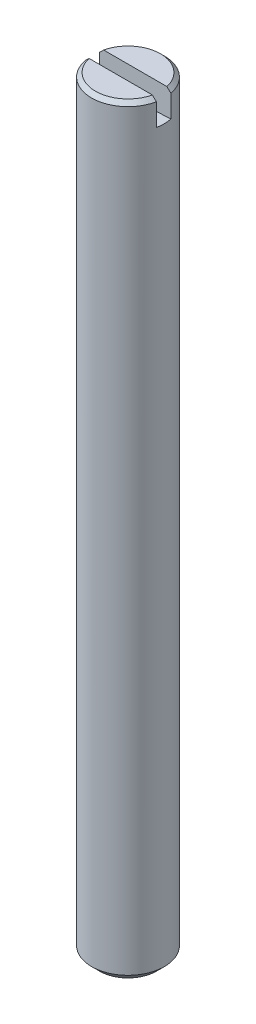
ISO-10303-21;
HEADER;
FILE_DESCRIPTION(('STEP AP214'),'2;1');
FILE_NAME('part.step','',(''),(''),'','','');
FILE_SCHEMA(('AUTOMOTIVE_DESIGN { 1 0 10303 214 1 1 1 1 }'));
ENDSEC;
DATA;
#1=APPLICATION_CONTEXT('core data for automotive mechanical design processes');
#2=APPLICATION_PROTOCOL_DEFINITION('international standard','automotive_design',2000,#1);
#3=PRODUCT_CONTEXT('',#1,'mechanical');
#4=PRODUCT('Part','Part','',(#3));
#5=PRODUCT_RELATED_PRODUCT_CATEGORY('part','',(#4));
#6=PRODUCT_DEFINITION_FORMATION('','',#4);
#7=PRODUCT_DEFINITION_CONTEXT('part definition',#1,'design');
#8=PRODUCT_DEFINITION('design','',#6,#7);
#9=PRODUCT_DEFINITION_SHAPE('','',#8);
#10=(LENGTH_UNIT() NAMED_UNIT(*) SI_UNIT(.MILLI.,.METRE.));
#11=(NAMED_UNIT(*) PLANE_ANGLE_UNIT() SI_UNIT($,.RADIAN.));
#12=(NAMED_UNIT(*) SI_UNIT($,.STERADIAN.) SOLID_ANGLE_UNIT());
#13=UNCERTAINTY_MEASURE_WITH_UNIT(LENGTH_MEASURE(1.E-05),#10,'distance_accuracy_value','');
#14=(GEOMETRIC_REPRESENTATION_CONTEXT(3) GLOBAL_UNCERTAINTY_ASSIGNED_CONTEXT((#13)) GLOBAL_UNIT_ASSIGNED_CONTEXT((#10,
#11,#12)) REPRESENTATION_CONTEXT('',''));
#15=CARTESIAN_POINT('',(0.,0.,0.));
#16=DIRECTION('',(0.,0.,1.));
#17=DIRECTION('',(1.,0.,0.));
#18=AXIS2_PLACEMENT_3D('',#15,#16,#17);
#19=CARTESIAN_POINT('',(0.,22.,0.));
#20=DIRECTION('',(0.,-1.,0.));
#21=DIRECTION('',(0.,0.,-1.));
#22=AXIS2_PLACEMENT_3D('',#19,#20,#21);
#23=PLANE('',#22);
#24=CARTESIAN_POINT('',(0.,21.9999999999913,0.));
#25=DIRECTION('',(0.,-1.,0.));
#26=DIRECTION('',(0.,0.,-1.));
#27=AXIS2_PLACEMENT_3D('',#24,#25,#26);
#28=CIRCLE('',#27,1.78549999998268);
#29=CARTESIAN_POINT('',(-1.74011788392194,21.9999999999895,-0.4));
#30=VERTEX_POINT('',#29);
#31=CARTESIAN_POINT('',(1.74011788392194,21.9999999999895,-0.4));
#32=VERTEX_POINT('',#31);
#33=EDGE_CURVE('E87',#30,#32,#28,.T.);
#34=ORIENTED_EDGE('',*,*,#33,.F.);
#35=DIRECTION('',(1.,0.,0.));
#36=VECTOR('',#35,1.);
#37=CARTESIAN_POINT('',(0.,22.,-0.4));
#38=LINE('',#37,#36);
#39=EDGE_CURVE('E19',#32,#30,#38,.F.);
#40=ORIENTED_EDGE('',*,*,#39,.F.);
#41=EDGE_LOOP('',(#34,#40));
#42=FACE_BOUND('',#41,.T.);
#43=ADVANCED_FACE('F14',(#42),#23,.F.);
#44=CARTESIAN_POINT('',(0.,22.,0.));
#45=DIRECTION('',(0.,-1.,0.));
#46=DIRECTION('',(0.,0.,-1.));
#47=AXIS2_PLACEMENT_3D('',#44,#45,#46);
#48=PLANE('',#47);
#49=DIRECTION('',(1.,0.,0.));
#50=VECTOR('',#49,1.);
#51=CARTESIAN_POINT('',(0.,22.,0.4));
#52=LINE('',#51,#50);
#53=CARTESIAN_POINT('',(-1.74011788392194,21.9999999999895,0.4));
#54=VERTEX_POINT('',#53);
#55=CARTESIAN_POINT('',(1.74011788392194,21.9999999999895,0.4));
#56=VERTEX_POINT('',#55);
#57=EDGE_CURVE('E81',#54,#56,#52,.T.);
#58=ORIENTED_EDGE('',*,*,#57,.F.);
#59=CARTESIAN_POINT('',(0.,21.9999999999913,0.));
#60=DIRECTION('',(0.,-1.,0.));
#61=DIRECTION('',(0.,0.,-1.));
#62=AXIS2_PLACEMENT_3D('',#59,#60,#61);
#63=CIRCLE('',#62,1.78549999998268);
#64=EDGE_CURVE('E74',#56,#54,#63,.T.);
#65=ORIENTED_EDGE('',*,*,#64,.F.);
#66=EDGE_LOOP('',(#58,#65));
#67=FACE_BOUND('',#66,.T.);
#68=ADVANCED_FACE('F86',(#67),#48,.F.);
#69=CARTESIAN_POINT('',(0.,21.7854999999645,0.));
#70=DIRECTION('',(0.,-1.,0.));
#71=DIRECTION('',(0.,0.,-1.));
#72=AXIS2_PLACEMENT_3D('',#69,#70,#71);
#73=CONICAL_SURFACE('',#72,2.00000000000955,0.785398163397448);
#74=CARTESIAN_POINT('',(-1.74011788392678,21.9999999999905,-0.400000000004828));
#75=CARTESIAN_POINT('',(-1.77674437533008,21.9642986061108,-0.400000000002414));
#76=CARTESIAN_POINT('',(-1.81334711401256,21.9285729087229,-0.400000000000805));
#77=CARTESIAN_POINT('',(-1.88650508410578,21.8570729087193,-0.399999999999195));
#78=CARTESIAN_POINT('',(-1.9230603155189,21.8212986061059,-0.399999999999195));
#79=CARTESIAN_POINT('',(-1.95959179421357,21.7854999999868,-0.4));
#80=B_SPLINE_CURVE_WITH_KNOTS('',3,(#74,#75,#76,#77,#78,#79),.UNSPECIFIED.,.F.,.F.,(4,2,4),(0.,
0.153443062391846,0.306886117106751),.UNSPECIFIED.);
#81=CARTESIAN_POINT('',(-1.95959179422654,21.785499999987,-0.4));
#82=VERTEX_POINT('',#81);
#83=EDGE_CURVE('E85',#30,#82,#80,.T.);
#84=ORIENTED_EDGE('',*,*,#83,.F.);
#85=ORIENTED_EDGE('',*,*,#33,.T.);
#86=CARTESIAN_POINT('',(1.95959179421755,21.7854999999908,-0.40000000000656));
#87=CARTESIAN_POINT('',(1.92306031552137,21.8212986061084,-0.40000000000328));
#88=CARTESIAN_POINT('',(1.88650508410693,21.8570729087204,-0.400000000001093));
#89=CARTESIAN_POINT('',(1.81334711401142,21.9285729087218,-0.399999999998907));
#90=CARTESIAN_POINT('',(1.77674437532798,21.9642986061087,-0.399999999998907));
#91=CARTESIAN_POINT('',(1.7401178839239,21.9999999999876,-0.4));
#92=B_SPLINE_CURVE_WITH_KNOTS('',3,(#86,#87,#88,#89,#90,#91),.UNSPECIFIED.,.F.,.F.,(4,2,4),(0.,
0.153443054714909,0.306886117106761),.UNSPECIFIED.);
#93=CARTESIAN_POINT('',(1.95959179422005,21.7854999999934,-0.4));
#94=VERTEX_POINT('',#93);
#95=EDGE_CURVE('E112',#94,#32,#92,.T.);
#96=ORIENTED_EDGE('',*,*,#95,.F.);
#97=CARTESIAN_POINT('',(0.,21.7855,0.));
#98=DIRECTION('',(0.,-1.,0.));
#99=DIRECTION('',(0.,0.,-1.));
#100=AXIS2_PLACEMENT_3D('',#97,#98,#99);
#101=CIRCLE('',#100,2.);
#102=EDGE_CURVE('E101',#82,#94,#101,.T.);
#103=ORIENTED_EDGE('',*,*,#102,.F.);
#104=EDGE_LOOP('',(#84,#85,#96,#103));
#105=FACE_BOUND('',#104,.T.);
#106=ADVANCED_FACE('F128',(#105),#73,.T.);
#107=CARTESIAN_POINT('',(0.,52.,-0.4));
#108=DIRECTION('',(0.,0.,1.));
#109=DIRECTION('',(1.,0.,0.));
#110=AXIS2_PLACEMENT_3D('',#107,#108,#109);
#111=PLANE('',#110);
#112=ORIENTED_EDGE('',*,*,#39,.T.);
#113=ORIENTED_EDGE('',*,*,#83,.T.);
#114=DIRECTION('',(0.,1.,0.));
#115=VECTOR('',#114,1.);
#116=CARTESIAN_POINT('',(-1.95959179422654,52.,-0.4));
#117=LINE('',#116,#115);
#118=CARTESIAN_POINT('',(-1.95959179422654,20.5610114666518,-0.4));
#119=VERTEX_POINT('',#118);
#120=EDGE_CURVE('E58',#82,#119,#117,.F.);
#121=ORIENTED_EDGE('',*,*,#120,.T.);
#122=CARTESIAN_POINT('',(0.,52.,-0.4));
#123=DIRECTION('',(0.,0.,-1.));
#124=DIRECTION('',(-1.,0.,0.));
#125=AXIS2_PLACEMENT_3D('',#122,#123,#124);
#126=CIRCLE('',#125,31.5);
#127=CARTESIAN_POINT('',(1.95959179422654,20.5610114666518,-0.4));
#128=VERTEX_POINT('',#127);
#129=EDGE_CURVE('E109',#119,#128,#126,.F.);
#130=ORIENTED_EDGE('',*,*,#129,.T.);
#131=DIRECTION('',(0.,1.,0.));
#132=VECTOR('',#131,1.);
#133=CARTESIAN_POINT('',(1.95959179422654,52.,-0.4));
#134=LINE('',#133,#132);
#135=EDGE_CURVE('E110',#128,#94,#134,.T.);
#136=ORIENTED_EDGE('',*,*,#135,.T.);
#137=ORIENTED_EDGE('',*,*,#95,.T.);
#138=EDGE_LOOP('',(#112,#113,#121,#130,#136,#137));
#139=FACE_BOUND('',#138,.T.);
#140=ADVANCED_FACE('F124',(#139),#111,.T.);
#141=CARTESIAN_POINT('',(0.,21.7854999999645,0.));
#142=DIRECTION('',(0.,-1.,0.));
#143=DIRECTION('',(0.,0.,-1.));
#144=AXIS2_PLACEMENT_3D('',#141,#142,#143);
#145=CONICAL_SURFACE('',#144,2.00000000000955,0.785398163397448);
#146=ORIENTED_EDGE('',*,*,#64,.T.);
#147=CARTESIAN_POINT('',(-1.74011788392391,21.9999999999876,0.4));
#148=CARTESIAN_POINT('',(-1.77674437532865,21.9642986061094,0.4));
#149=CARTESIAN_POINT('',(-1.81334711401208,21.9285729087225,0.4));
#150=CARTESIAN_POINT('',(-1.88650508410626,21.8570729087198,0.4));
#151=CARTESIAN_POINT('',(-1.92306031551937,21.8212986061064,0.4));
#152=CARTESIAN_POINT('',(-1.95959179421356,21.7854999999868,0.4));
#153=B_SPLINE_CURVE_WITH_KNOTS('',3,(#147,#148,#149,#150,#151,#152),.UNSPECIFIED.,.F.,.F.,(4,2,
4),(0.,0.153443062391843,0.306886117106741),.UNSPECIFIED.);
#154=CARTESIAN_POINT('',(-1.95959179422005,21.7854999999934,0.4));
#155=VERTEX_POINT('',#154);
#156=EDGE_CURVE('E34',#54,#155,#153,.T.);
#157=ORIENTED_EDGE('',*,*,#156,.T.);
#158=CARTESIAN_POINT('',(0.,21.7855,0.));
#159=DIRECTION('',(0.,-1.,0.));
#160=DIRECTION('',(0.,0.,-1.));
#161=AXIS2_PLACEMENT_3D('',#158,#159,#160);
#162=CIRCLE('',#161,2.);
#163=CARTESIAN_POINT('',(1.95959179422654,21.785499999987,0.4));
#164=VERTEX_POINT('',#163);
#165=EDGE_CURVE('E75',#164,#155,#162,.T.);
#166=ORIENTED_EDGE('',*,*,#165,.F.);
#167=CARTESIAN_POINT('',(1.95959179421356,21.7854999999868,0.4));
#168=CARTESIAN_POINT('',(1.92306031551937,21.8212986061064,0.4));
#169=CARTESIAN_POINT('',(1.88650508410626,21.8570729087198,0.4));
#170=CARTESIAN_POINT('',(1.81334711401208,21.9285729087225,0.4));
#171=CARTESIAN_POINT('',(1.77674437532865,21.9642986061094,0.4));
#172=CARTESIAN_POINT('',(1.74011788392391,21.9999999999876,0.4));
#173=B_SPLINE_CURVE_WITH_KNOTS('',3,(#167,#168,#169,#170,#171,#172),.UNSPECIFIED.,.F.,.F.,(4,2,
4),(0.,0.153443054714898,0.306886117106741),.UNSPECIFIED.);
#174=EDGE_CURVE('E70',#164,#56,#173,.T.);
#175=ORIENTED_EDGE('',*,*,#174,.T.);
#176=EDGE_LOOP('',(#146,#157,#166,#175));
#177=FACE_BOUND('',#176,.T.);
#178=ADVANCED_FACE('F72',(#177),#145,.T.);
#179=CARTESIAN_POINT('',(0.,52.,0.4));
#180=DIRECTION('',(0.,0.,1.));
#181=DIRECTION('',(1.,0.,0.));
#182=AXIS2_PLACEMENT_3D('',#179,#180,#181);
#183=PLANE('',#182);
#184=ORIENTED_EDGE('',*,*,#57,.T.);
#185=ORIENTED_EDGE('',*,*,#174,.F.);
#186=DIRECTION('',(0.,1.,0.));
#187=VECTOR('',#186,1.);
#188=CARTESIAN_POINT('',(1.95959179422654,52.,0.4));
#189=LINE('',#188,#187);
#190=CARTESIAN_POINT('',(1.95959179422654,20.5610114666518,0.4));
#191=VERTEX_POINT('',#190);
#192=EDGE_CURVE('E78',#191,#164,#189,.T.);
#193=ORIENTED_EDGE('',*,*,#192,.F.);
#194=CARTESIAN_POINT('',(0.,52.,0.4));
#195=DIRECTION('',(0.,0.,-1.));
#196=DIRECTION('',(-1.,0.,0.));
#197=AXIS2_PLACEMENT_3D('',#194,#195,#196);
#198=CIRCLE('',#197,31.5);
#199=CARTESIAN_POINT('',(-1.95959179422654,20.5610114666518,0.4));
#200=VERTEX_POINT('',#199);
#201=EDGE_CURVE('E106',#200,#191,#198,.F.);
#202=ORIENTED_EDGE('',*,*,#201,.F.);
#203=DIRECTION('',(0.,1.,0.));
#204=VECTOR('',#203,1.);
#205=CARTESIAN_POINT('',(-1.95959179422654,52.,0.4));
#206=LINE('',#205,#204);
#207=EDGE_CURVE('E104',#155,#200,#206,.F.);
#208=ORIENTED_EDGE('',*,*,#207,.F.);
#209=ORIENTED_EDGE('',*,*,#156,.F.);
#210=EDGE_LOOP('',(#184,#185,#193,#202,#208,#209));
#211=FACE_BOUND('',#210,.T.);
#212=ADVANCED_FACE('F82',(#211),#183,.F.);
#213=CARTESIAN_POINT('',(0.,52.,0.4));
#214=DIRECTION('',(0.,0.,-1.));
#215=DIRECTION('',(-1.,0.,0.));
#216=AXIS2_PLACEMENT_3D('',#213,#214,#215);
#217=CYLINDRICAL_SURFACE('',#216,31.5);
#218=CARTESIAN_POINT('',(1.95959179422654,20.5610114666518,-0.4));
#219=CARTESIAN_POINT('',(1.97091486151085,20.5617184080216,-0.344561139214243));
#220=CARTESIAN_POINT('',(1.97987306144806,20.562281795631,-0.288637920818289));
#221=CARTESIAN_POINT('',(1.99302430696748,20.5631121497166,-0.1762131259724));
#222=CARTESIAN_POINT('',(1.99721579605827,20.5633790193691,-0.119711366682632));
#223=CARTESIAN_POINT('',(2.0007609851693,20.5636046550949,-0.00749894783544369));
#224=CARTESIAN_POINT('',(2.00019410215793,20.5635684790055,0.0482092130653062));
#225=CARTESIAN_POINT('',(1.99441663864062,20.5632012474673,0.15936012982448));
#226=CARTESIAN_POINT('',(1.98920814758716,20.5628703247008,0.21480299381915));
#227=CARTESIAN_POINT('',(1.97576492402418,20.562023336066,0.313516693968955));
#228=CARTESIAN_POINT('',(1.96839158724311,20.561560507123,0.356906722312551));
#229=CARTESIAN_POINT('',(1.95959179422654,20.5610114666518,0.4));
#230=B_SPLINE_CURVE_WITH_KNOTS('',3,(#218,#219,#220,#221,#222,#223,#224,#225,#226,#227,#228,
#229),.UNSPECIFIED.,.F.,.F.,(4,2,2,2,2,4),(0.,0.169712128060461,0.33947965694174,
0.506419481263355,0.673284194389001,0.805229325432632),.UNSPECIFIED.);
#231=EDGE_CURVE('E25',#128,#191,#230,.T.);
#232=ORIENTED_EDGE('',*,*,#231,.F.);
#233=ORIENTED_EDGE('',*,*,#129,.F.);
#234=CARTESIAN_POINT('',(-1.95959179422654,20.5610114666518,0.4));
#235=CARTESIAN_POINT('',(-1.97091486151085,20.5617184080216,0.344561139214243));
#236=CARTESIAN_POINT('',(-1.97987306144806,20.562281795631,0.28863792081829));
#237=CARTESIAN_POINT('',(-1.99302430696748,20.5631121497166,0.176213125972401));
#238=CARTESIAN_POINT('',(-1.99721579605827,20.5633790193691,0.119711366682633));
#239=CARTESIAN_POINT('',(-2.0007609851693,20.5636046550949,0.00749894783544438));
#240=CARTESIAN_POINT('',(-2.00019410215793,20.5635684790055,-0.0482092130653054));
#241=CARTESIAN_POINT('',(-1.99441663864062,20.5632012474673,-0.159360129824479));
#242=CARTESIAN_POINT('',(-1.98920814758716,20.5628703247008,-0.214802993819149));
#243=CARTESIAN_POINT('',(-1.97576492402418,20.562023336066,-0.313516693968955));
#244=CARTESIAN_POINT('',(-1.96839158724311,20.561560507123,-0.356906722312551));
#245=CARTESIAN_POINT('',(-1.95959179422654,20.5610114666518,-0.4));
#246=B_SPLINE_CURVE_WITH_KNOTS('',3,(#234,#235,#236,#237,#238,#239,#240,#241,#242,#243,#244,
#245),.UNSPECIFIED.,.F.,.F.,(4,2,2,2,2,4),(0.,0.169712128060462,0.33947965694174,
0.506419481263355,0.673284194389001,0.805229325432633),.UNSPECIFIED.);
#247=EDGE_CURVE('E9',#200,#119,#246,.T.);
#248=ORIENTED_EDGE('',*,*,#247,.F.);
#249=ORIENTED_EDGE('',*,*,#201,.T.);
#250=EDGE_LOOP('',(#232,#233,#248,#249));
#251=FACE_BOUND('',#250,.T.);
#252=ADVANCED_FACE('F151',(#251),#217,.F.);
#253=CARTESIAN_POINT('',(0.,15.,0.));
#254=DIRECTION('',(0.,-1.,0.));
#255=DIRECTION('',(0.,0.,-1.));
#256=AXIS2_PLACEMENT_3D('',#253,#254,#255);
#257=CYLINDRICAL_SURFACE('',#256,2.);
#258=ORIENTED_EDGE('',*,*,#231,.T.);
#259=ORIENTED_EDGE('',*,*,#192,.T.);
#260=ORIENTED_EDGE('',*,*,#165,.T.);
#261=ORIENTED_EDGE('',*,*,#207,.T.);
#262=ORIENTED_EDGE('',*,*,#247,.T.);
#263=ORIENTED_EDGE('',*,*,#120,.F.);
#264=ORIENTED_EDGE('',*,*,#102,.T.);
#265=ORIENTED_EDGE('',*,*,#135,.F.);
#266=EDGE_LOOP('',(#258,#259,#260,#261,#262,#263,#264,#265));
#267=FACE_BOUND('',#266,.T.);
#268=CARTESIAN_POINT('',(0.,-19.5705,0.));
#269=DIRECTION('',(0.,-1.,0.));
#270=DIRECTION('',(0.,0.,-1.));
#271=AXIS2_PLACEMENT_3D('',#268,#269,#270);
#272=CIRCLE('',#271,2.);
#273=CARTESIAN_POINT('',(0.,-19.5705,-2.));
#274=VERTEX_POINT('',#273);
#275=EDGE_CURVE('E103',#274,#274,#272,.T.);
#276=ORIENTED_EDGE('',*,*,#275,.F.);
#277=EDGE_LOOP('',(#276));
#278=FACE_BOUND('',#277,.T.);
#279=ADVANCED_FACE('F16',(#267,#278),#257,.T.);
#280=CARTESIAN_POINT('',(1.5705,-20.,0.));
#281=DIRECTION('',(0.,1.,0.));
#282=DIRECTION('',(0.,0.,1.));
#283=AXIS2_PLACEMENT_3D('',#280,#281,#282);
#284=PLANE('',#283);
#285=CARTESIAN_POINT('',(0.,-20.0000000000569,0.));
#286=DIRECTION('',(0.,1.,0.));
#287=DIRECTION('',(-1.,0.,0.));
#288=AXIS2_PLACEMENT_3D('',#285,#286,#287);
#289=CIRCLE('',#288,1.57050000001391);
#290=CARTESIAN_POINT('',(-1.57050000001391,-20.0000000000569,0.));
#291=VERTEX_POINT('',#290);
#292=EDGE_CURVE('E171',#291,#291,#289,.T.);
#293=ORIENTED_EDGE('',*,*,#292,.F.);
#294=EDGE_LOOP('',(#293));
#295=FACE_BOUND('',#294,.T.);
#296=ADVANCED_FACE('F157',(#295),#284,.F.);
#297=CARTESIAN_POINT('',(0.,-19.5705000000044,0.));
#298=DIRECTION('',(0.,1.,0.));
#299=DIRECTION('',(-1.,0.,0.));
#300=AXIS2_PLACEMENT_3D('',#297,#298,#299);
#301=CONICAL_SURFACE('',#300,2.00000000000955,0.785398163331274);
#302=ORIENTED_EDGE('',*,*,#275,.T.);
#303=EDGE_LOOP('',(#302));
#304=FACE_BOUND('',#303,.T.);
#305=ORIENTED_EDGE('',*,*,#292,.T.);
#306=EDGE_LOOP('',(#305));
#307=FACE_BOUND('',#306,.T.);
#308=ADVANCED_FACE('F177',(#304,#307),#301,.T.);
#309=CLOSED_SHELL('',(#43,#68,#106,#140,#178,#212,#252,#279,#296,#308));
#310=MANIFOLD_SOLID_BREP('B1',#309);
#311=ADVANCED_BREP_SHAPE_REPRESENTATION('',(#18,#310),#14);
#312=SHAPE_DEFINITION_REPRESENTATION(#9,#311);
ENDSEC;
END-ISO-10303-21;
